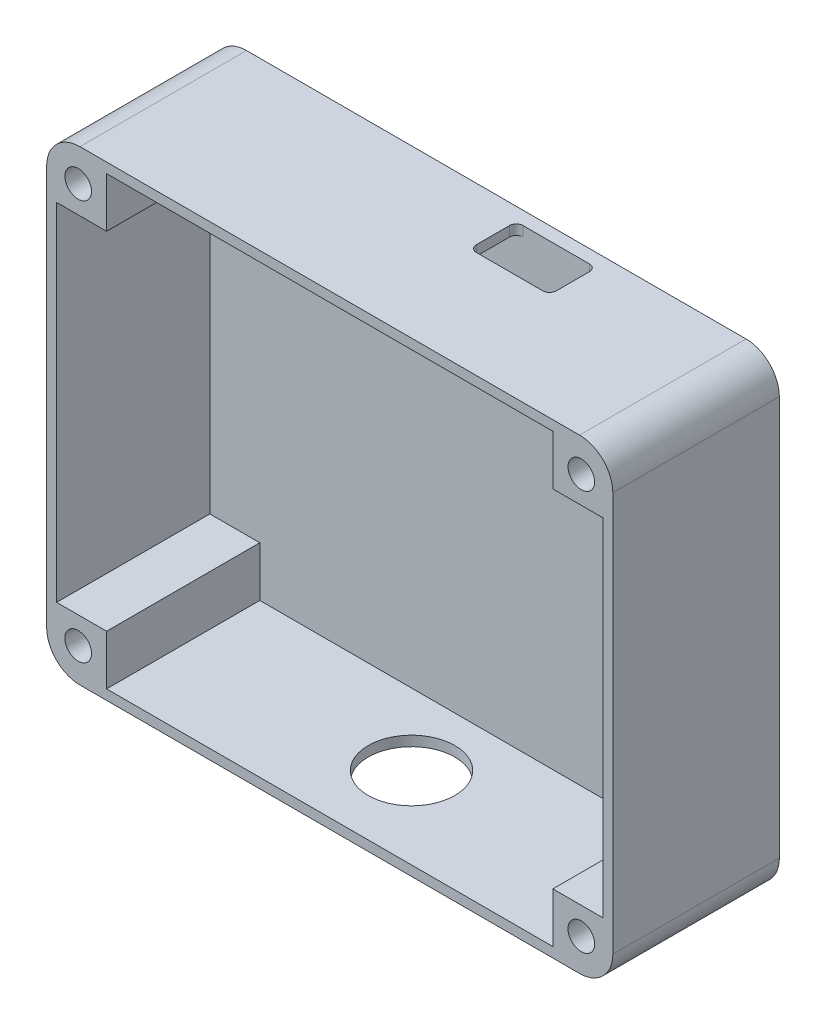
ISO-10303-21;
HEADER;
FILE_DESCRIPTION(('STEP AP214'),'2;1');
FILE_NAME('part.step','',(''),(''),'','','');
FILE_SCHEMA(('AUTOMOTIVE_DESIGN { 1 0 10303 214 1 1 1 1 }'));
ENDSEC;
DATA;
#1=APPLICATION_CONTEXT('core data for automotive mechanical design processes');
#2=APPLICATION_PROTOCOL_DEFINITION('international standard','automotive_design',2000,#1);
#3=PRODUCT_CONTEXT('',#1,'mechanical');
#4=PRODUCT('Part','Part','',(#3));
#5=PRODUCT_RELATED_PRODUCT_CATEGORY('part','',(#4));
#6=PRODUCT_DEFINITION_FORMATION('','',#4);
#7=PRODUCT_DEFINITION_CONTEXT('part definition',#1,'design');
#8=PRODUCT_DEFINITION('design','',#6,#7);
#9=PRODUCT_DEFINITION_SHAPE('','',#8);
#10=(LENGTH_UNIT() NAMED_UNIT(*) SI_UNIT(.MILLI.,.METRE.));
#11=(NAMED_UNIT(*) PLANE_ANGLE_UNIT() SI_UNIT($,.RADIAN.));
#12=(NAMED_UNIT(*) SI_UNIT($,.STERADIAN.) SOLID_ANGLE_UNIT());
#13=UNCERTAINTY_MEASURE_WITH_UNIT(LENGTH_MEASURE(1.E-05),#10,'distance_accuracy_value','');
#14=(GEOMETRIC_REPRESENTATION_CONTEXT(3) GLOBAL_UNCERTAINTY_ASSIGNED_CONTEXT((#13)) GLOBAL_UNIT_ASSIGNED_CONTEXT((#10,
#11,#12)) REPRESENTATION_CONTEXT('',''));
#15=CARTESIAN_POINT('',(0.,0.,0.));
#16=DIRECTION('',(0.,0.,1.));
#17=DIRECTION('',(1.,0.,0.));
#18=AXIS2_PLACEMENT_3D('',#15,#16,#17);
#19=CARTESIAN_POINT('',(37.5,30.,25.));
#20=DIRECTION('',(0.,0.,1.));
#21=DIRECTION('',(1.,0.,0.));
#22=AXIS2_PLACEMENT_3D('',#19,#20,#21);
#23=PLANE('',#22);
#24=CARTESIAN_POINT('',(-37.7680246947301,-30.0366040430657,25.));
#25=DIRECTION('',(0.,0.,1.));
#26=DIRECTION('',(-1.,0.,0.));
#27=AXIS2_PLACEMENT_3D('',#24,#25,#26);
#28=CIRCLE('',#27,2.);
#29=CARTESIAN_POINT('',(-39.7680246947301,-30.0366040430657,25.));
#30=VERTEX_POINT('',#29);
#31=EDGE_CURVE('E274',#30,#30,#28,.T.);
#32=ORIENTED_EDGE('',*,*,#31,.F.);
#33=EDGE_LOOP('',(#32));
#34=FACE_BOUND('',#33,.T.);
#35=CARTESIAN_POINT('',(37.7680246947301,-30.0366040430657,25.));
#36=DIRECTION('',(0.,0.,1.));
#37=DIRECTION('',(1.,0.,0.));
#38=AXIS2_PLACEMENT_3D('',#35,#36,#37);
#39=CIRCLE('',#38,2.);
#40=CARTESIAN_POINT('',(39.7680246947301,-30.0366040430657,25.));
#41=VERTEX_POINT('',#40);
#42=EDGE_CURVE('E285',#41,#41,#39,.T.);
#43=ORIENTED_EDGE('',*,*,#42,.F.);
#44=EDGE_LOOP('',(#43));
#45=FACE_BOUND('',#44,.T.);
#46=CARTESIAN_POINT('',(37.7680246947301,30.0366040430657,25.));
#47=DIRECTION('',(0.,0.,1.));
#48=DIRECTION('',(-1.,0.,0.));
#49=AXIS2_PLACEMENT_3D('',#46,#47,#48);
#50=CIRCLE('',#49,2.);
#51=CARTESIAN_POINT('',(35.7680246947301,30.0366040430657,25.));
#52=VERTEX_POINT('',#51);
#53=EDGE_CURVE('E279',#52,#52,#50,.T.);
#54=ORIENTED_EDGE('',*,*,#53,.F.);
#55=EDGE_LOOP('',(#54));
#56=FACE_BOUND('',#55,.T.);
#57=CARTESIAN_POINT('',(-37.7680246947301,30.0366040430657,25.));
#58=DIRECTION('',(0.,0.,1.));
#59=DIRECTION('',(1.,0.,0.));
#60=AXIS2_PLACEMENT_3D('',#57,#58,#59);
#61=CIRCLE('',#60,2.);
#62=CARTESIAN_POINT('',(-35.7680246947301,30.0366040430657,25.));
#63=VERTEX_POINT('',#62);
#64=EDGE_CURVE('E278',#63,#63,#61,.T.);
#65=ORIENTED_EDGE('',*,*,#64,.F.);
#66=EDGE_LOOP('',(#65));
#67=FACE_BOUND('',#66,.T.);
#68=CARTESIAN_POINT('',(37.5,30.,25.));
#69=DIRECTION('',(0.,0.,1.));
#70=DIRECTION('',(1.,0.,0.));
#71=AXIS2_PLACEMENT_3D('',#68,#69,#70);
#72=CIRCLE('',#71,5.);
#73=CARTESIAN_POINT('',(42.5,30.,25.));
#74=VERTEX_POINT('',#73);
#75=CARTESIAN_POINT('',(37.5,35.,25.));
#76=VERTEX_POINT('',#75);
#77=EDGE_CURVE('E392',#74,#76,#72,.T.);
#78=ORIENTED_EDGE('',*,*,#77,.T.);
#79=DIRECTION('',(-1.,0.,0.));
#80=VECTOR('',#79,1.);
#81=CARTESIAN_POINT('',(-37.5,35.,25.));
#82=LINE('',#81,#80);
#83=CARTESIAN_POINT('',(-37.5,35.,25.));
#84=VERTEX_POINT('',#83);
#85=EDGE_CURVE('E395',#76,#84,#82,.T.);
#86=ORIENTED_EDGE('',*,*,#85,.T.);
#87=CARTESIAN_POINT('',(-37.5,30.,25.));
#88=DIRECTION('',(0.,0.,1.));
#89=DIRECTION('',(-1.,0.,0.));
#90=AXIS2_PLACEMENT_3D('',#87,#88,#89);
#91=CIRCLE('',#90,5.);
#92=CARTESIAN_POINT('',(-42.5,30.,25.));
#93=VERTEX_POINT('',#92);
#94=EDGE_CURVE('E398',#84,#93,#91,.T.);
#95=ORIENTED_EDGE('',*,*,#94,.T.);
#96=DIRECTION('',(0.,-1.,0.));
#97=VECTOR('',#96,1.);
#98=CARTESIAN_POINT('',(-42.5,30.,25.));
#99=LINE('',#98,#97);
#100=CARTESIAN_POINT('',(-42.5,-30.,25.));
#101=VERTEX_POINT('',#100);
#102=EDGE_CURVE('E400',#93,#101,#99,.T.);
#103=ORIENTED_EDGE('',*,*,#102,.T.);
#104=CARTESIAN_POINT('',(-37.5,-30.,25.));
#105=DIRECTION('',(0.,0.,1.));
#106=DIRECTION('',(-1.,0.,0.));
#107=AXIS2_PLACEMENT_3D('',#104,#105,#106);
#108=CIRCLE('',#107,5.);
#109=CARTESIAN_POINT('',(-37.5,-35.,25.));
#110=VERTEX_POINT('',#109);
#111=EDGE_CURVE('E402',#101,#110,#108,.T.);
#112=ORIENTED_EDGE('',*,*,#111,.T.);
#113=DIRECTION('',(1.,0.,0.));
#114=VECTOR('',#113,1.);
#115=CARTESIAN_POINT('',(-37.5,-35.,25.));
#116=LINE('',#115,#114);
#117=CARTESIAN_POINT('',(37.5,-35.,25.));
#118=VERTEX_POINT('',#117);
#119=EDGE_CURVE('E404',#110,#118,#116,.T.);
#120=ORIENTED_EDGE('',*,*,#119,.T.);
#121=CARTESIAN_POINT('',(37.5,-30.,25.));
#122=DIRECTION('',(0.,0.,1.));
#123=DIRECTION('',(-1.,0.,0.));
#124=AXIS2_PLACEMENT_3D('',#121,#122,#123);
#125=CIRCLE('',#124,5.);
#126=CARTESIAN_POINT('',(42.5,-30.,25.));
#127=VERTEX_POINT('',#126);
#128=EDGE_CURVE('E406',#118,#127,#125,.T.);
#129=ORIENTED_EDGE('',*,*,#128,.T.);
#130=DIRECTION('',(0.,1.,0.));
#131=VECTOR('',#130,1.);
#132=CARTESIAN_POINT('',(42.5,30.,25.));
#133=LINE('',#132,#131);
#134=EDGE_CURVE('E408',#127,#74,#133,.T.);
#135=ORIENTED_EDGE('',*,*,#134,.T.);
#136=EDGE_LOOP('',(#78,#86,#95,#103,#112,#120,#129,#135));
#137=FACE_BOUND('',#136,.T.);
#138=DIRECTION('',(0.,1.,0.));
#139=VECTOR('',#138,1.);
#140=CARTESIAN_POINT('',(-33.5000000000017,-2.10757337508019E-12,25.));
#141=LINE('',#140,#139);
#142=CARTESIAN_POINT('',(-33.4999999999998,-33.5,25.));
#143=VERTEX_POINT('',#142);
#144=CARTESIAN_POINT('',(-33.5,-26.,25.));
#145=VERTEX_POINT('',#144);
#146=EDGE_CURVE('E335',#143,#145,#141,.T.);
#147=ORIENTED_EDGE('',*,*,#146,.T.);
#148=DIRECTION('',(-1.,0.,0.));
#149=VECTOR('',#148,1.);
#150=CARTESIAN_POINT('',(0.,-26.,25.));
#151=LINE('',#150,#149);
#152=CARTESIAN_POINT('',(-41.,-26.,25.));
#153=VERTEX_POINT('',#152);
#154=EDGE_CURVE('E296',#145,#153,#151,.T.);
#155=ORIENTED_EDGE('',*,*,#154,.T.);
#156=DIRECTION('',(0.,-1.,0.));
#157=VECTOR('',#156,1.);
#158=CARTESIAN_POINT('',(-41.,0.,25.));
#159=LINE('',#158,#157);
#160=CARTESIAN_POINT('',(-41.,26.,25.));
#161=VERTEX_POINT('',#160);
#162=EDGE_CURVE('E302',#161,#153,#159,.T.);
#163=ORIENTED_EDGE('',*,*,#162,.F.);
#164=DIRECTION('',(-1.,0.,0.));
#165=VECTOR('',#164,1.);
#166=CARTESIAN_POINT('',(0.,26.,25.));
#167=LINE('',#166,#165);
#168=CARTESIAN_POINT('',(-33.5,26.,25.));
#169=VERTEX_POINT('',#168);
#170=EDGE_CURVE('E362',#169,#161,#167,.T.);
#171=ORIENTED_EDGE('',*,*,#170,.F.);
#172=DIRECTION('',(0.,-1.,0.));
#173=VECTOR('',#172,1.);
#174=CARTESIAN_POINT('',(-33.5,0.,25.));
#175=LINE('',#174,#173);
#176=CARTESIAN_POINT('',(-33.5,33.5,25.));
#177=VERTEX_POINT('',#176);
#178=EDGE_CURVE('E359',#177,#169,#175,.T.);
#179=ORIENTED_EDGE('',*,*,#178,.F.);
#180=DIRECTION('',(1.,0.,0.));
#181=VECTOR('',#180,1.);
#182=CARTESIAN_POINT('',(0.,33.5,25.));
#183=LINE('',#182,#181);
#184=CARTESIAN_POINT('',(33.5,33.5,25.));
#185=VERTEX_POINT('',#184);
#186=EDGE_CURVE('E356',#177,#185,#183,.T.);
#187=ORIENTED_EDGE('',*,*,#186,.T.);
#188=DIRECTION('',(0.,-1.,0.));
#189=VECTOR('',#188,1.);
#190=CARTESIAN_POINT('',(33.5,0.,25.));
#191=LINE('',#190,#189);
#192=CARTESIAN_POINT('',(33.5,26.,25.));
#193=VERTEX_POINT('',#192);
#194=EDGE_CURVE('E353',#185,#193,#191,.T.);
#195=ORIENTED_EDGE('',*,*,#194,.T.);
#196=DIRECTION('',(1.,0.,0.));
#197=VECTOR('',#196,1.);
#198=CARTESIAN_POINT('',(0.,26.,25.));
#199=LINE('',#198,#197);
#200=CARTESIAN_POINT('',(41.,26.,25.));
#201=VERTEX_POINT('',#200);
#202=EDGE_CURVE('E350',#193,#201,#199,.T.);
#203=ORIENTED_EDGE('',*,*,#202,.T.);
#204=DIRECTION('',(0.,-1.,0.));
#205=VECTOR('',#204,1.);
#206=CARTESIAN_POINT('',(41.,0.,25.));
#207=LINE('',#206,#205);
#208=CARTESIAN_POINT('',(41.,-26.,25.));
#209=VERTEX_POINT('',#208);
#210=EDGE_CURVE('E347',#201,#209,#207,.T.);
#211=ORIENTED_EDGE('',*,*,#210,.T.);
#212=DIRECTION('',(1.,0.,0.));
#213=VECTOR('',#212,1.);
#214=CARTESIAN_POINT('',(0.,-26.,25.));
#215=LINE('',#214,#213);
#216=CARTESIAN_POINT('',(33.4999999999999,-26.,25.));
#217=VERTEX_POINT('',#216);
#218=EDGE_CURVE('E344',#217,#209,#215,.T.);
#219=ORIENTED_EDGE('',*,*,#218,.F.);
#220=DIRECTION('',(0.,1.,0.));
#221=VECTOR('',#220,1.);
#222=CARTESIAN_POINT('',(33.4999999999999,0.,25.));
#223=LINE('',#222,#221);
#224=CARTESIAN_POINT('',(33.4999999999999,-33.5,25.));
#225=VERTEX_POINT('',#224);
#226=EDGE_CURVE('E341',#225,#217,#223,.T.);
#227=ORIENTED_EDGE('',*,*,#226,.F.);
#228=DIRECTION('',(1.,0.,0.));
#229=VECTOR('',#228,1.);
#230=CARTESIAN_POINT('',(0.,-33.5,25.));
#231=LINE('',#230,#229);
#232=EDGE_CURVE('E338',#143,#225,#231,.T.);
#233=ORIENTED_EDGE('',*,*,#232,.F.);
#234=EDGE_LOOP('',(#147,#155,#163,#171,#179,#187,#195,#203,#211,#219,#227,#233));
#235=FACE_BOUND('',#234,.T.);
#236=ADVANCED_FACE('F38',(#34,#45,#56,#67,#137,#235),#23,.T.);
#237=CARTESIAN_POINT('',(37.5,30.,25.));
#238=DIRECTION('',(0.,0.,-1.));
#239=DIRECTION('',(-1.,0.,0.));
#240=AXIS2_PLACEMENT_3D('',#237,#238,#239);
#241=CYLINDRICAL_SURFACE('',#240,5.);
#242=CARTESIAN_POINT('',(37.5,30.,0.));
#243=DIRECTION('',(0.,0.,1.));
#244=DIRECTION('',(1.,0.,0.));
#245=AXIS2_PLACEMENT_3D('',#242,#243,#244);
#246=CIRCLE('',#245,5.);
#247=CARTESIAN_POINT('',(42.5,30.,0.));
#248=VERTEX_POINT('',#247);
#249=CARTESIAN_POINT('',(37.5,35.,0.));
#250=VERTEX_POINT('',#249);
#251=EDGE_CURVE('E369',#248,#250,#246,.T.);
#252=ORIENTED_EDGE('',*,*,#251,.T.);
#253=DIRECTION('',(0.,0.,-1.));
#254=VECTOR('',#253,1.);
#255=CARTESIAN_POINT('',(37.5,35.,25.));
#256=LINE('',#255,#254);
#257=EDGE_CURVE('E446',#76,#250,#256,.T.);
#258=ORIENTED_EDGE('',*,*,#257,.F.);
#259=ORIENTED_EDGE('',*,*,#77,.F.);
#260=DIRECTION('',(0.,0.,-1.));
#261=VECTOR('',#260,1.);
#262=CARTESIAN_POINT('',(42.5,30.,25.));
#263=LINE('',#262,#261);
#264=EDGE_CURVE('E410',#74,#248,#263,.T.);
#265=ORIENTED_EDGE('',*,*,#264,.T.);
#266=EDGE_LOOP('',(#252,#258,#259,#265));
#267=FACE_BOUND('',#266,.T.);
#268=ADVANCED_FACE('F40',(#267),#241,.T.);
#269=CARTESIAN_POINT('',(-37.5,35.,25.));
#270=DIRECTION('',(0.,-1.,0.));
#271=DIRECTION('',(0.,0.,-1.));
#272=AXIS2_PLACEMENT_3D('',#269,#270,#271);
#273=PLANE('',#272);
#274=DIRECTION('',(0.,0.,-1.));
#275=VECTOR('',#274,1.);
#276=CARTESIAN_POINT('',(17.,35.,3.00000000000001));
#277=LINE('',#276,#275);
#278=CARTESIAN_POINT('',(17.,35.,7.99999999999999));
#279=VERTEX_POINT('',#278);
#280=CARTESIAN_POINT('',(17.,35.,3.00000000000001));
#281=VERTEX_POINT('',#280);
#282=EDGE_CURVE('E234',#279,#281,#277,.T.);
#283=ORIENTED_EDGE('',*,*,#282,.F.);
#284=CARTESIAN_POINT('',(16.,35.,8.));
#285=DIRECTION('',(0.,1.,0.));
#286=DIRECTION('',(0.,0.,1.));
#287=AXIS2_PLACEMENT_3D('',#284,#285,#286);
#288=CIRCLE('',#287,1.);
#289=CARTESIAN_POINT('',(16.,35.,9.));
#290=VERTEX_POINT('',#289);
#291=EDGE_CURVE('E54',#290,#279,#288,.T.);
#292=ORIENTED_EDGE('',*,*,#291,.F.);
#293=DIRECTION('',(1.,0.,0.));
#294=VECTOR('',#293,1.);
#295=CARTESIAN_POINT('',(6.00000000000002,35.,9.));
#296=LINE('',#295,#294);
#297=CARTESIAN_POINT('',(6.00000000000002,35.,9.));
#298=VERTEX_POINT('',#297);
#299=EDGE_CURVE('E256',#298,#290,#296,.T.);
#300=ORIENTED_EDGE('',*,*,#299,.F.);
#301=CARTESIAN_POINT('',(6.00000000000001,35.,8.));
#302=DIRECTION('',(0.,1.,0.));
#303=DIRECTION('',(0.,0.,-1.));
#304=AXIS2_PLACEMENT_3D('',#301,#302,#303);
#305=CIRCLE('',#304,1.);
#306=CARTESIAN_POINT('',(5.00000000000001,35.,7.99999999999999));
#307=VERTEX_POINT('',#306);
#308=EDGE_CURVE('E253',#307,#298,#305,.T.);
#309=ORIENTED_EDGE('',*,*,#308,.F.);
#310=DIRECTION('',(0.,0.,1.));
#311=VECTOR('',#310,1.);
#312=CARTESIAN_POINT('',(5.00000000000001,35.,3.00000000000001));
#313=LINE('',#312,#311);
#314=CARTESIAN_POINT('',(5.00000000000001,35.,3.00000000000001));
#315=VERTEX_POINT('',#314);
#316=EDGE_CURVE('E250',#315,#307,#313,.T.);
#317=ORIENTED_EDGE('',*,*,#316,.F.);
#318=CARTESIAN_POINT('',(6.00000000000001,35.,3.));
#319=DIRECTION('',(0.,1.,0.));
#320=DIRECTION('',(0.,0.,-1.));
#321=AXIS2_PLACEMENT_3D('',#318,#319,#320);
#322=CIRCLE('',#321,1.);
#323=CARTESIAN_POINT('',(6.00000000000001,35.,2.));
#324=VERTEX_POINT('',#323);
#325=EDGE_CURVE('E244',#324,#315,#322,.T.);
#326=ORIENTED_EDGE('',*,*,#325,.F.);
#327=DIRECTION('',(-1.,0.,0.));
#328=VECTOR('',#327,1.);
#329=CARTESIAN_POINT('',(6.00000000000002,35.,2.));
#330=LINE('',#329,#328);
#331=CARTESIAN_POINT('',(16.,35.,2.));
#332=VERTEX_POINT('',#331);
#333=EDGE_CURVE('E242',#332,#324,#330,.T.);
#334=ORIENTED_EDGE('',*,*,#333,.F.);
#335=CARTESIAN_POINT('',(16.,35.,3.));
#336=DIRECTION('',(0.,1.,0.));
#337=DIRECTION('',(0.,0.,1.));
#338=AXIS2_PLACEMENT_3D('',#335,#336,#337);
#339=CIRCLE('',#338,1.);
#340=EDGE_CURVE('E225',#281,#332,#339,.T.);
#341=ORIENTED_EDGE('',*,*,#340,.F.);
#342=EDGE_LOOP('',(#283,#292,#300,#309,#317,#326,#334,#341));
#343=FACE_BOUND('',#342,.T.);
#344=DIRECTION('',(-1.,0.,0.));
#345=VECTOR('',#344,1.);
#346=CARTESIAN_POINT('',(-37.5,35.,0.));
#347=LINE('',#346,#345);
#348=CARTESIAN_POINT('',(-37.5,35.,0.));
#349=VERTEX_POINT('',#348);
#350=EDGE_CURVE('E413',#250,#349,#347,.T.);
#351=ORIENTED_EDGE('',*,*,#350,.T.);
#352=DIRECTION('',(0.,0.,-1.));
#353=VECTOR('',#352,1.);
#354=CARTESIAN_POINT('',(-37.5,35.,25.));
#355=LINE('',#354,#353);
#356=EDGE_CURVE('E443',#84,#349,#355,.T.);
#357=ORIENTED_EDGE('',*,*,#356,.F.);
#358=ORIENTED_EDGE('',*,*,#85,.F.);
#359=ORIENTED_EDGE('',*,*,#257,.T.);
#360=EDGE_LOOP('',(#351,#357,#358,#359));
#361=FACE_BOUND('',#360,.T.);
#362=ADVANCED_FACE('F238',(#343,#361),#273,.F.);
#363=CARTESIAN_POINT('',(-37.5,30.,25.));
#364=DIRECTION('',(0.,0.,-1.));
#365=DIRECTION('',(-1.,0.,0.));
#366=AXIS2_PLACEMENT_3D('',#363,#364,#365);
#367=CYLINDRICAL_SURFACE('',#366,5.);
#368=CARTESIAN_POINT('',(-37.5,30.,0.));
#369=DIRECTION('',(0.,0.,1.));
#370=DIRECTION('',(-1.,0.,0.));
#371=AXIS2_PLACEMENT_3D('',#368,#369,#370);
#372=CIRCLE('',#371,5.);
#373=CARTESIAN_POINT('',(-42.5,30.,0.));
#374=VERTEX_POINT('',#373);
#375=EDGE_CURVE('E415',#349,#374,#372,.T.);
#376=ORIENTED_EDGE('',*,*,#375,.T.);
#377=DIRECTION('',(0.,0.,-1.));
#378=VECTOR('',#377,1.);
#379=CARTESIAN_POINT('',(-42.5,30.,25.));
#380=LINE('',#379,#378);
#381=EDGE_CURVE('E440',#93,#374,#380,.T.);
#382=ORIENTED_EDGE('',*,*,#381,.F.);
#383=ORIENTED_EDGE('',*,*,#94,.F.);
#384=ORIENTED_EDGE('',*,*,#356,.T.);
#385=EDGE_LOOP('',(#376,#382,#383,#384));
#386=FACE_BOUND('',#385,.T.);
#387=ADVANCED_FACE('F533',(#386),#367,.T.);
#388=CARTESIAN_POINT('',(-42.5,30.,25.));
#389=DIRECTION('',(1.,0.,0.));
#390=DIRECTION('',(0.,1.,0.));
#391=AXIS2_PLACEMENT_3D('',#388,#389,#390);
#392=PLANE('',#391);
#393=DIRECTION('',(0.,-1.,0.));
#394=VECTOR('',#393,1.);
#395=CARTESIAN_POINT('',(-42.5,30.,0.));
#396=LINE('',#395,#394);
#397=CARTESIAN_POINT('',(-42.5,-30.,0.));
#398=VERTEX_POINT('',#397);
#399=EDGE_CURVE('E417',#374,#398,#396,.T.);
#400=ORIENTED_EDGE('',*,*,#399,.T.);
#401=DIRECTION('',(0.,0.,-1.));
#402=VECTOR('',#401,1.);
#403=CARTESIAN_POINT('',(-42.5,-30.,25.));
#404=LINE('',#403,#402);
#405=EDGE_CURVE('E437',#101,#398,#404,.T.);
#406=ORIENTED_EDGE('',*,*,#405,.F.);
#407=ORIENTED_EDGE('',*,*,#102,.F.);
#408=ORIENTED_EDGE('',*,*,#381,.T.);
#409=EDGE_LOOP('',(#400,#406,#407,#408));
#410=FACE_BOUND('',#409,.T.);
#411=ADVANCED_FACE('F529',(#410),#392,.F.);
#412=CARTESIAN_POINT('',(-37.5,-30.,25.));
#413=DIRECTION('',(0.,0.,-1.));
#414=DIRECTION('',(-1.,0.,0.));
#415=AXIS2_PLACEMENT_3D('',#412,#413,#414);
#416=CYLINDRICAL_SURFACE('',#415,5.);
#417=CARTESIAN_POINT('',(-37.5,-30.,0.));
#418=DIRECTION('',(0.,0.,1.));
#419=DIRECTION('',(-1.,0.,0.));
#420=AXIS2_PLACEMENT_3D('',#417,#418,#419);
#421=CIRCLE('',#420,5.);
#422=CARTESIAN_POINT('',(-37.5,-35.,0.));
#423=VERTEX_POINT('',#422);
#424=EDGE_CURVE('E419',#398,#423,#421,.T.);
#425=ORIENTED_EDGE('',*,*,#424,.T.);
#426=DIRECTION('',(0.,0.,-1.));
#427=VECTOR('',#426,1.);
#428=CARTESIAN_POINT('',(-37.5,-35.,25.));
#429=LINE('',#428,#427);
#430=EDGE_CURVE('E434',#110,#423,#429,.T.);
#431=ORIENTED_EDGE('',*,*,#430,.F.);
#432=ORIENTED_EDGE('',*,*,#111,.F.);
#433=ORIENTED_EDGE('',*,*,#405,.T.);
#434=EDGE_LOOP('',(#425,#431,#432,#433));
#435=FACE_BOUND('',#434,.T.);
#436=ADVANCED_FACE('F525',(#435),#416,.T.);
#437=CARTESIAN_POINT('',(-37.5,-35.,25.));
#438=DIRECTION('',(0.,1.,0.));
#439=DIRECTION('',(0.,0.,1.));
#440=AXIS2_PLACEMENT_3D('',#437,#438,#439);
#441=PLANE('',#440);
#442=CARTESIAN_POINT('',(0.,-35.,12.7210704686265));
#443=DIRECTION('',(0.,-1.,0.));
#444=DIRECTION('',(0.,0.,-1.));
#445=AXIS2_PLACEMENT_3D('',#442,#443,#444);
#446=CIRCLE('',#445,6.5);
#447=CARTESIAN_POINT('',(0.,-35.,6.22107046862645));
#448=VERTEX_POINT('',#447);
#449=EDGE_CURVE('E798',#448,#448,#446,.T.);
#450=ORIENTED_EDGE('',*,*,#449,.F.);
#451=EDGE_LOOP('',(#450));
#452=FACE_BOUND('',#451,.T.);
#453=DIRECTION('',(1.,0.,0.));
#454=VECTOR('',#453,1.);
#455=CARTESIAN_POINT('',(-37.5,-35.,0.));
#456=LINE('',#455,#454);
#457=CARTESIAN_POINT('',(37.5,-35.,0.));
#458=VERTEX_POINT('',#457);
#459=EDGE_CURVE('E421',#423,#458,#456,.T.);
#460=ORIENTED_EDGE('',*,*,#459,.T.);
#461=DIRECTION('',(0.,0.,-1.));
#462=VECTOR('',#461,1.);
#463=CARTESIAN_POINT('',(37.5,-35.,25.));
#464=LINE('',#463,#462);
#465=EDGE_CURVE('E431',#118,#458,#464,.T.);
#466=ORIENTED_EDGE('',*,*,#465,.F.);
#467=ORIENTED_EDGE('',*,*,#119,.F.);
#468=ORIENTED_EDGE('',*,*,#430,.T.);
#469=EDGE_LOOP('',(#460,#466,#467,#468));
#470=FACE_BOUND('',#469,.T.);
#471=ADVANCED_FACE('F521',(#452,#470),#441,.F.);
#472=CARTESIAN_POINT('',(37.5,-30.,25.));
#473=DIRECTION('',(0.,0.,-1.));
#474=DIRECTION('',(-1.,0.,0.));
#475=AXIS2_PLACEMENT_3D('',#472,#473,#474);
#476=CYLINDRICAL_SURFACE('',#475,5.);
#477=CARTESIAN_POINT('',(37.5,-30.,0.));
#478=DIRECTION('',(0.,0.,1.));
#479=DIRECTION('',(-1.,0.,0.));
#480=AXIS2_PLACEMENT_3D('',#477,#478,#479);
#481=CIRCLE('',#480,5.);
#482=CARTESIAN_POINT('',(42.5,-30.,0.));
#483=VERTEX_POINT('',#482);
#484=EDGE_CURVE('E423',#458,#483,#481,.T.);
#485=ORIENTED_EDGE('',*,*,#484,.T.);
#486=DIRECTION('',(0.,0.,-1.));
#487=VECTOR('',#486,1.);
#488=CARTESIAN_POINT('',(42.5,-30.,25.));
#489=LINE('',#488,#487);
#490=EDGE_CURVE('E428',#127,#483,#489,.T.);
#491=ORIENTED_EDGE('',*,*,#490,.F.);
#492=ORIENTED_EDGE('',*,*,#128,.F.);
#493=ORIENTED_EDGE('',*,*,#465,.T.);
#494=EDGE_LOOP('',(#485,#491,#492,#493));
#495=FACE_BOUND('',#494,.T.);
#496=ADVANCED_FACE('F517',(#495),#476,.T.);
#497=CARTESIAN_POINT('',(42.5,30.,25.));
#498=DIRECTION('',(-1.,0.,0.));
#499=DIRECTION('',(0.,-1.,0.));
#500=AXIS2_PLACEMENT_3D('',#497,#498,#499);
#501=PLANE('',#500);
#502=DIRECTION('',(0.,1.,0.));
#503=VECTOR('',#502,1.);
#504=CARTESIAN_POINT('',(42.5,30.,0.));
#505=LINE('',#504,#503);
#506=EDGE_CURVE('E396',#483,#248,#505,.T.);
#507=ORIENTED_EDGE('',*,*,#506,.T.);
#508=ORIENTED_EDGE('',*,*,#264,.F.);
#509=ORIENTED_EDGE('',*,*,#134,.F.);
#510=ORIENTED_EDGE('',*,*,#490,.T.);
#511=EDGE_LOOP('',(#507,#508,#509,#510));
#512=FACE_BOUND('',#511,.T.);
#513=ADVANCED_FACE('F513',(#512),#501,.F.);
#514=CARTESIAN_POINT('',(37.5,30.,0.));
#515=DIRECTION('',(0.,0.,1.));
#516=DIRECTION('',(1.,0.,0.));
#517=AXIS2_PLACEMENT_3D('',#514,#515,#516);
#518=PLANE('',#517);
#519=ORIENTED_EDGE('',*,*,#251,.F.);
#520=ORIENTED_EDGE('',*,*,#506,.F.);
#521=ORIENTED_EDGE('',*,*,#484,.F.);
#522=ORIENTED_EDGE('',*,*,#459,.F.);
#523=ORIENTED_EDGE('',*,*,#424,.F.);
#524=ORIENTED_EDGE('',*,*,#399,.F.);
#525=ORIENTED_EDGE('',*,*,#375,.F.);
#526=ORIENTED_EDGE('',*,*,#350,.F.);
#527=EDGE_LOOP('',(#519,#520,#521,#522,#523,#524,#525,#526));
#528=FACE_BOUND('',#527,.T.);
#529=ADVANCED_FACE('F510',(#528),#518,.F.);
#530=CARTESIAN_POINT('',(0.,-26.,2.));
#531=DIRECTION('',(0.,1.,0.));
#532=DIRECTION('',(0.,0.,1.));
#533=AXIS2_PLACEMENT_3D('',#530,#531,#532);
#534=PLANE('',#533);
#535=ORIENTED_EDGE('',*,*,#154,.F.);
#536=DIRECTION('',(0.,0.,1.));
#537=VECTOR('',#536,1.);
#538=CARTESIAN_POINT('',(-33.5,-26.,2.));
#539=LINE('',#538,#537);
#540=CARTESIAN_POINT('',(-33.5,-26.,2.));
#541=VERTEX_POINT('',#540);
#542=EDGE_CURVE('E332',#541,#145,#539,.T.);
#543=ORIENTED_EDGE('',*,*,#542,.F.);
#544=DIRECTION('',(-1.,0.,0.));
#545=VECTOR('',#544,1.);
#546=CARTESIAN_POINT('',(0.,-26.,2.));
#547=LINE('',#546,#545);
#548=CARTESIAN_POINT('',(-41.,-26.,2.));
#549=VERTEX_POINT('',#548);
#550=EDGE_CURVE('E299',#541,#549,#547,.T.);
#551=ORIENTED_EDGE('',*,*,#550,.T.);
#552=DIRECTION('',(0.,0.,1.));
#553=VECTOR('',#552,1.);
#554=CARTESIAN_POINT('',(-41.,-26.,2.));
#555=LINE('',#554,#553);
#556=EDGE_CURVE('E367',#549,#153,#555,.T.);
#557=ORIENTED_EDGE('',*,*,#556,.T.);
#558=EDGE_LOOP('',(#535,#543,#551,#557));
#559=FACE_BOUND('',#558,.T.);
#560=ADVANCED_FACE('F508',(#559),#534,.T.);
#561=CARTESIAN_POINT('',(-41.,0.,2.));
#562=DIRECTION('',(-1.,0.,0.));
#563=DIRECTION('',(0.,-1.,0.));
#564=AXIS2_PLACEMENT_3D('',#561,#562,#563);
#565=PLANE('',#564);
#566=ORIENTED_EDGE('',*,*,#162,.T.);
#567=ORIENTED_EDGE('',*,*,#556,.F.);
#568=DIRECTION('',(0.,-1.,0.));
#569=VECTOR('',#568,1.);
#570=CARTESIAN_POINT('',(-41.,0.,2.));
#571=LINE('',#570,#569);
#572=CARTESIAN_POINT('',(-41.,26.,2.));
#573=VERTEX_POINT('',#572);
#574=EDGE_CURVE('E329',#573,#549,#571,.T.);
#575=ORIENTED_EDGE('',*,*,#574,.F.);
#576=DIRECTION('',(0.,0.,1.));
#577=VECTOR('',#576,1.);
#578=CARTESIAN_POINT('',(-41.,26.,2.));
#579=LINE('',#578,#577);
#580=EDGE_CURVE('E370',#573,#161,#579,.T.);
#581=ORIENTED_EDGE('',*,*,#580,.T.);
#582=EDGE_LOOP('',(#566,#567,#575,#581));
#583=FACE_BOUND('',#582,.T.);
#584=ADVANCED_FACE('F580',(#583),#565,.F.);
#585=CARTESIAN_POINT('',(0.,26.,2.));
#586=DIRECTION('',(0.,1.,0.));
#587=DIRECTION('',(0.,0.,1.));
#588=AXIS2_PLACEMENT_3D('',#585,#586,#587);
#589=PLANE('',#588);
#590=ORIENTED_EDGE('',*,*,#170,.T.);
#591=ORIENTED_EDGE('',*,*,#580,.F.);
#592=DIRECTION('',(-1.,0.,0.));
#593=VECTOR('',#592,1.);
#594=CARTESIAN_POINT('',(0.,26.,2.));
#595=LINE('',#594,#593);
#596=CARTESIAN_POINT('',(-33.5,26.,2.));
#597=VERTEX_POINT('',#596);
#598=EDGE_CURVE('E326',#597,#573,#595,.T.);
#599=ORIENTED_EDGE('',*,*,#598,.F.);
#600=DIRECTION('',(0.,0.,1.));
#601=VECTOR('',#600,1.);
#602=CARTESIAN_POINT('',(-33.5,26.,2.));
#603=LINE('',#602,#601);
#604=EDGE_CURVE('E372',#597,#169,#603,.T.);
#605=ORIENTED_EDGE('',*,*,#604,.T.);
#606=EDGE_LOOP('',(#590,#591,#599,#605));
#607=FACE_BOUND('',#606,.T.);
#608=ADVANCED_FACE('F587',(#607),#589,.F.);
#609=CARTESIAN_POINT('',(-33.5,0.,2.));
#610=DIRECTION('',(-1.,0.,0.));
#611=DIRECTION('',(0.,0.,1.));
#612=AXIS2_PLACEMENT_3D('',#609,#610,#611);
#613=PLANE('',#612);
#614=ORIENTED_EDGE('',*,*,#178,.T.);
#615=ORIENTED_EDGE('',*,*,#604,.F.);
#616=DIRECTION('',(0.,-1.,0.));
#617=VECTOR('',#616,1.);
#618=CARTESIAN_POINT('',(-33.5,0.,2.));
#619=LINE('',#618,#617);
#620=CARTESIAN_POINT('',(-33.5,33.5,2.));
#621=VERTEX_POINT('',#620);
#622=EDGE_CURVE('E323',#621,#597,#619,.T.);
#623=ORIENTED_EDGE('',*,*,#622,.F.);
#624=DIRECTION('',(0.,0.,1.));
#625=VECTOR('',#624,1.);
#626=CARTESIAN_POINT('',(-33.5,33.5,2.));
#627=LINE('',#626,#625);
#628=EDGE_CURVE('E374',#621,#177,#627,.T.);
#629=ORIENTED_EDGE('',*,*,#628,.T.);
#630=EDGE_LOOP('',(#614,#615,#623,#629));
#631=FACE_BOUND('',#630,.T.);
#632=ADVANCED_FACE('F595',(#631),#613,.F.);
#633=CARTESIAN_POINT('',(0.,33.5,2.));
#634=DIRECTION('',(0.,-1.,0.));
#635=DIRECTION('',(0.,0.,-1.));
#636=AXIS2_PLACEMENT_3D('',#633,#634,#635);
#637=PLANE('',#636);
#638=CARTESIAN_POINT('',(6.00000000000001,33.5,3.));
#639=DIRECTION('',(0.,-1.,0.));
#640=DIRECTION('',(0.,0.,-1.));
#641=AXIS2_PLACEMENT_3D('',#638,#639,#640);
#642=CIRCLE('',#641,1.);
#643=CARTESIAN_POINT('',(5.00000000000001,33.5,3.00000000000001));
#644=VERTEX_POINT('',#643);
#645=CARTESIAN_POINT('',(6.00000000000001,33.5,2.));
#646=VERTEX_POINT('',#645);
#647=EDGE_CURVE('E272',#644,#646,#642,.T.);
#648=ORIENTED_EDGE('',*,*,#647,.F.);
#649=DIRECTION('',(0.,0.,-1.));
#650=VECTOR('',#649,1.);
#651=CARTESIAN_POINT('',(5.00000000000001,33.5,2.));
#652=LINE('',#651,#650);
#653=CARTESIAN_POINT('',(5.00000000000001,33.5,7.99999999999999));
#654=VERTEX_POINT('',#653);
#655=EDGE_CURVE('E11',#654,#644,#652,.T.);
#656=ORIENTED_EDGE('',*,*,#655,.F.);
#657=CARTESIAN_POINT('',(6.00000000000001,33.5,8.));
#658=DIRECTION('',(0.,-1.,0.));
#659=DIRECTION('',(0.,0.,-1.));
#660=AXIS2_PLACEMENT_3D('',#657,#658,#659);
#661=CIRCLE('',#660,1.);
#662=CARTESIAN_POINT('',(6.00000000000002,33.5,9.));
#663=VERTEX_POINT('',#662);
#664=EDGE_CURVE('E47',#663,#654,#661,.T.);
#665=ORIENTED_EDGE('',*,*,#664,.F.);
#666=DIRECTION('',(-1.,0.,0.));
#667=VECTOR('',#666,1.);
#668=CARTESIAN_POINT('',(0.,33.5,9.));
#669=LINE('',#668,#667);
#670=CARTESIAN_POINT('',(16.,33.5,9.));
#671=VERTEX_POINT('',#670);
#672=EDGE_CURVE('E453',#671,#663,#669,.T.);
#673=ORIENTED_EDGE('',*,*,#672,.F.);
#674=CARTESIAN_POINT('',(16.,33.5,8.));
#675=DIRECTION('',(0.,-1.,0.));
#676=DIRECTION('',(0.,0.,-1.));
#677=AXIS2_PLACEMENT_3D('',#674,#675,#676);
#678=CIRCLE('',#677,1.);
#679=CARTESIAN_POINT('',(17.,33.5,7.99999999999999));
#680=VERTEX_POINT('',#679);
#681=EDGE_CURVE('E451',#680,#671,#678,.T.);
#682=ORIENTED_EDGE('',*,*,#681,.F.);
#683=DIRECTION('',(0.,0.,1.));
#684=VECTOR('',#683,1.);
#685=CARTESIAN_POINT('',(17.,33.5,2.));
#686=LINE('',#685,#684);
#687=CARTESIAN_POINT('',(17.,33.5,3.00000000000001));
#688=VERTEX_POINT('',#687);
#689=EDGE_CURVE('E449',#688,#680,#686,.T.);
#690=ORIENTED_EDGE('',*,*,#689,.F.);
#691=CARTESIAN_POINT('',(16.,33.5,3.));
#692=DIRECTION('',(0.,-1.,0.));
#693=DIRECTION('',(0.,0.,-1.));
#694=AXIS2_PLACEMENT_3D('',#691,#692,#693);
#695=CIRCLE('',#694,1.);
#696=CARTESIAN_POINT('',(16.,33.5,2.));
#697=VERTEX_POINT('',#696);
#698=EDGE_CURVE('E228',#697,#688,#695,.T.);
#699=ORIENTED_EDGE('',*,*,#698,.F.);
#700=DIRECTION('',(1.,0.,0.));
#701=VECTOR('',#700,1.);
#702=CARTESIAN_POINT('',(0.,33.5,2.));
#703=LINE('',#702,#701);
#704=CARTESIAN_POINT('',(33.5,33.5,2.));
#705=VERTEX_POINT('',#704);
#706=EDGE_CURVE('E319',#697,#705,#703,.T.);
#707=ORIENTED_EDGE('',*,*,#706,.T.);
#708=DIRECTION('',(0.,0.,1.));
#709=VECTOR('',#708,1.);
#710=CARTESIAN_POINT('',(33.5,33.5,2.));
#711=LINE('',#710,#709);
#712=EDGE_CURVE('E376',#705,#185,#711,.T.);
#713=ORIENTED_EDGE('',*,*,#712,.T.);
#714=ORIENTED_EDGE('',*,*,#186,.F.);
#715=ORIENTED_EDGE('',*,*,#628,.F.);
#716=EDGE_CURVE('E320',#621,#646,#703,.T.);
#717=ORIENTED_EDGE('',*,*,#716,.T.);
#718=EDGE_LOOP('',(#648,#656,#665,#673,#682,#690,#699,#707,#713,#714,#715,#717));
#719=FACE_BOUND('',#718,.T.);
#720=ADVANCED_FACE('F469',(#719),#637,.T.);
#721=CARTESIAN_POINT('',(33.5,0.,2.));
#722=DIRECTION('',(-1.,0.,0.));
#723=DIRECTION('',(0.,0.,1.));
#724=AXIS2_PLACEMENT_3D('',#721,#722,#723);
#725=PLANE('',#724);
#726=ORIENTED_EDGE('',*,*,#194,.F.);
#727=ORIENTED_EDGE('',*,*,#712,.F.);
#728=DIRECTION('',(0.,-1.,0.));
#729=VECTOR('',#728,1.);
#730=CARTESIAN_POINT('',(33.5,0.,2.));
#731=LINE('',#730,#729);
#732=CARTESIAN_POINT('',(33.5,26.,2.));
#733=VERTEX_POINT('',#732);
#734=EDGE_CURVE('E317',#705,#733,#731,.T.);
#735=ORIENTED_EDGE('',*,*,#734,.T.);
#736=DIRECTION('',(0.,0.,1.));
#737=VECTOR('',#736,1.);
#738=CARTESIAN_POINT('',(33.5,26.,2.));
#739=LINE('',#738,#737);
#740=EDGE_CURVE('E378',#733,#193,#739,.T.);
#741=ORIENTED_EDGE('',*,*,#740,.T.);
#742=EDGE_LOOP('',(#726,#727,#735,#741));
#743=FACE_BOUND('',#742,.T.);
#744=ADVANCED_FACE('F610',(#743),#725,.T.);
#745=CARTESIAN_POINT('',(0.,26.,2.));
#746=DIRECTION('',(0.,-1.,0.));
#747=DIRECTION('',(0.,0.,-1.));
#748=AXIS2_PLACEMENT_3D('',#745,#746,#747);
#749=PLANE('',#748);
#750=ORIENTED_EDGE('',*,*,#202,.F.);
#751=ORIENTED_EDGE('',*,*,#740,.F.);
#752=DIRECTION('',(1.,0.,0.));
#753=VECTOR('',#752,1.);
#754=CARTESIAN_POINT('',(0.,26.,2.));
#755=LINE('',#754,#753);
#756=CARTESIAN_POINT('',(41.,26.,2.));
#757=VERTEX_POINT('',#756);
#758=EDGE_CURVE('E315',#733,#757,#755,.T.);
#759=ORIENTED_EDGE('',*,*,#758,.T.);
#760=DIRECTION('',(0.,0.,1.));
#761=VECTOR('',#760,1.);
#762=CARTESIAN_POINT('',(41.,26.,2.));
#763=LINE('',#762,#761);
#764=EDGE_CURVE('E380',#757,#201,#763,.T.);
#765=ORIENTED_EDGE('',*,*,#764,.T.);
#766=EDGE_LOOP('',(#750,#751,#759,#765));
#767=FACE_BOUND('',#766,.T.);
#768=ADVANCED_FACE('F617',(#767),#749,.T.);
#769=CARTESIAN_POINT('',(41.,0.,2.));
#770=DIRECTION('',(-1.,0.,0.));
#771=DIRECTION('',(0.,-1.,0.));
#772=AXIS2_PLACEMENT_3D('',#769,#770,#771);
#773=PLANE('',#772);
#774=ORIENTED_EDGE('',*,*,#210,.F.);
#775=ORIENTED_EDGE('',*,*,#764,.F.);
#776=DIRECTION('',(0.,-1.,0.));
#777=VECTOR('',#776,1.);
#778=CARTESIAN_POINT('',(41.,0.,2.));
#779=LINE('',#778,#777);
#780=CARTESIAN_POINT('',(41.,-26.,2.));
#781=VERTEX_POINT('',#780);
#782=EDGE_CURVE('E313',#757,#781,#779,.T.);
#783=ORIENTED_EDGE('',*,*,#782,.T.);
#784=DIRECTION('',(0.,0.,1.));
#785=VECTOR('',#784,1.);
#786=CARTESIAN_POINT('',(41.,-26.,2.));
#787=LINE('',#786,#785);
#788=EDGE_CURVE('E382',#781,#209,#787,.T.);
#789=ORIENTED_EDGE('',*,*,#788,.T.);
#790=EDGE_LOOP('',(#774,#775,#783,#789));
#791=FACE_BOUND('',#790,.T.);
#792=ADVANCED_FACE('F625',(#791),#773,.T.);
#793=CARTESIAN_POINT('',(0.,-26.,2.));
#794=DIRECTION('',(0.,-1.,0.));
#795=DIRECTION('',(0.,0.,-1.));
#796=AXIS2_PLACEMENT_3D('',#793,#794,#795);
#797=PLANE('',#796);
#798=ORIENTED_EDGE('',*,*,#218,.T.);
#799=ORIENTED_EDGE('',*,*,#788,.F.);
#800=DIRECTION('',(1.,0.,0.));
#801=VECTOR('',#800,1.);
#802=CARTESIAN_POINT('',(0.,-26.,2.));
#803=LINE('',#802,#801);
#804=CARTESIAN_POINT('',(33.4999999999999,-26.,2.));
#805=VERTEX_POINT('',#804);
#806=EDGE_CURVE('E310',#805,#781,#803,.T.);
#807=ORIENTED_EDGE('',*,*,#806,.F.);
#808=DIRECTION('',(0.,0.,1.));
#809=VECTOR('',#808,1.);
#810=CARTESIAN_POINT('',(33.4999999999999,-26.,2.));
#811=LINE('',#810,#809);
#812=EDGE_CURVE('E384',#805,#217,#811,.T.);
#813=ORIENTED_EDGE('',*,*,#812,.T.);
#814=EDGE_LOOP('',(#798,#799,#807,#813));
#815=FACE_BOUND('',#814,.T.);
#816=ADVANCED_FACE('F633',(#815),#797,.F.);
#817=CARTESIAN_POINT('',(33.4999999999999,0.,2.));
#818=DIRECTION('',(1.,0.,0.));
#819=DIRECTION('',(0.,0.,-1.));
#820=AXIS2_PLACEMENT_3D('',#817,#818,#819);
#821=PLANE('',#820);
#822=ORIENTED_EDGE('',*,*,#226,.T.);
#823=ORIENTED_EDGE('',*,*,#812,.F.);
#824=DIRECTION('',(0.,1.,0.));
#825=VECTOR('',#824,1.);
#826=CARTESIAN_POINT('',(33.4999999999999,0.,2.));
#827=LINE('',#826,#825);
#828=CARTESIAN_POINT('',(33.4999999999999,-33.5,2.));
#829=VERTEX_POINT('',#828);
#830=EDGE_CURVE('E307',#829,#805,#827,.T.);
#831=ORIENTED_EDGE('',*,*,#830,.F.);
#832=DIRECTION('',(0.,0.,1.));
#833=VECTOR('',#832,1.);
#834=CARTESIAN_POINT('',(33.4999999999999,-33.5,2.));
#835=LINE('',#834,#833);
#836=EDGE_CURVE('E386',#829,#225,#835,.T.);
#837=ORIENTED_EDGE('',*,*,#836,.T.);
#838=EDGE_LOOP('',(#822,#823,#831,#837));
#839=FACE_BOUND('',#838,.T.);
#840=ADVANCED_FACE('F641',(#839),#821,.F.);
#841=CARTESIAN_POINT('',(0.,-33.5,2.));
#842=DIRECTION('',(0.,-1.,0.));
#843=DIRECTION('',(0.,0.,-1.));
#844=AXIS2_PLACEMENT_3D('',#841,#842,#843);
#845=PLANE('',#844);
#846=CARTESIAN_POINT('',(0.,-33.5,12.7210704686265));
#847=DIRECTION('',(0.,-1.,0.));
#848=DIRECTION('',(0.,0.,-1.));
#849=AXIS2_PLACEMENT_3D('',#846,#847,#848);
#850=CIRCLE('',#849,6.5);
#851=CARTESIAN_POINT('',(0.,-33.5,6.22107046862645));
#852=VERTEX_POINT('',#851);
#853=EDGE_CURVE('E42',#852,#852,#850,.T.);
#854=ORIENTED_EDGE('',*,*,#853,.T.);
#855=EDGE_LOOP('',(#854));
#856=FACE_BOUND('',#855,.T.);
#857=ORIENTED_EDGE('',*,*,#232,.T.);
#858=ORIENTED_EDGE('',*,*,#836,.F.);
#859=DIRECTION('',(1.,0.,0.));
#860=VECTOR('',#859,1.);
#861=CARTESIAN_POINT('',(0.,-33.5,2.));
#862=LINE('',#861,#860);
#863=CARTESIAN_POINT('',(-33.4999999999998,-33.5,2.));
#864=VERTEX_POINT('',#863);
#865=EDGE_CURVE('E304',#864,#829,#862,.T.);
#866=ORIENTED_EDGE('',*,*,#865,.F.);
#867=DIRECTION('',(0.,0.,1.));
#868=VECTOR('',#867,1.);
#869=CARTESIAN_POINT('',(-33.4999999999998,-33.5,2.));
#870=LINE('',#869,#868);
#871=EDGE_CURVE('E388',#864,#143,#870,.T.);
#872=ORIENTED_EDGE('',*,*,#871,.T.);
#873=EDGE_LOOP('',(#857,#858,#866,#872));
#874=FACE_BOUND('',#873,.T.);
#875=ADVANCED_FACE('F649',(#856,#874),#845,.F.);
#876=CARTESIAN_POINT('',(-33.5000000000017,-2.10757337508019E-12,2.));
#877=DIRECTION('',(1.,0.,0.));
#878=DIRECTION('',(0.,1.,0.));
#879=AXIS2_PLACEMENT_3D('',#876,#877,#878);
#880=PLANE('',#879);
#881=ORIENTED_EDGE('',*,*,#146,.F.);
#882=ORIENTED_EDGE('',*,*,#871,.F.);
#883=DIRECTION('',(0.,1.,0.));
#884=VECTOR('',#883,1.);
#885=CARTESIAN_POINT('',(-33.5000000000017,-2.10757337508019E-12,2.));
#886=LINE('',#885,#884);
#887=EDGE_CURVE('E301',#864,#541,#886,.T.);
#888=ORIENTED_EDGE('',*,*,#887,.T.);
#889=ORIENTED_EDGE('',*,*,#542,.T.);
#890=EDGE_LOOP('',(#881,#882,#888,#889));
#891=FACE_BOUND('',#890,.T.);
#892=ADVANCED_FACE('F657',(#891),#880,.T.);
#893=CARTESIAN_POINT('',(0.,0.,2.));
#894=DIRECTION('',(0.,0.,1.));
#895=DIRECTION('',(1.,0.,0.));
#896=AXIS2_PLACEMENT_3D('',#893,#894,#895);
#897=PLANE('',#896);
#898=ORIENTED_EDGE('',*,*,#706,.F.);
#899=DIRECTION('',(0.,1.,0.));
#900=VECTOR('',#899,1.);
#901=CARTESIAN_POINT('',(16.,31.,2.));
#902=LINE('',#901,#900);
#903=EDGE_CURVE('E230',#697,#332,#902,.T.);
#904=ORIENTED_EDGE('',*,*,#903,.T.);
#905=ORIENTED_EDGE('',*,*,#333,.T.);
#906=DIRECTION('',(0.,1.,0.));
#907=VECTOR('',#906,1.);
#908=CARTESIAN_POINT('',(6.00000000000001,31.,2.));
#909=LINE('',#908,#907);
#910=EDGE_CURVE('E267',#646,#324,#909,.T.);
#911=ORIENTED_EDGE('',*,*,#910,.F.);
#912=ORIENTED_EDGE('',*,*,#716,.F.);
#913=ORIENTED_EDGE('',*,*,#622,.T.);
#914=ORIENTED_EDGE('',*,*,#598,.T.);
#915=ORIENTED_EDGE('',*,*,#574,.T.);
#916=ORIENTED_EDGE('',*,*,#550,.F.);
#917=ORIENTED_EDGE('',*,*,#887,.F.);
#918=ORIENTED_EDGE('',*,*,#865,.T.);
#919=ORIENTED_EDGE('',*,*,#830,.T.);
#920=ORIENTED_EDGE('',*,*,#806,.T.);
#921=ORIENTED_EDGE('',*,*,#782,.F.);
#922=ORIENTED_EDGE('',*,*,#758,.F.);
#923=ORIENTED_EDGE('',*,*,#734,.F.);
#924=EDGE_LOOP('',(#898,#904,#905,#911,#912,#913,#914,#915,#916,#917,#918,#919,#920,#921,#922,#923));
#925=FACE_BOUND('',#924,.T.);
#926=ADVANCED_FACE('F476',(#925),#897,.T.);
#927=CARTESIAN_POINT('',(-37.7680246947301,30.0366040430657,2.));
#928=DIRECTION('',(0.,0.,1.));
#929=DIRECTION('',(1.,0.,0.));
#930=AXIS2_PLACEMENT_3D('',#927,#928,#929);
#931=CYLINDRICAL_SURFACE('',#930,2.);
#932=CARTESIAN_POINT('',(-37.7680246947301,30.0366040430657,2.));
#933=DIRECTION('',(0.,0.,1.));
#934=DIRECTION('',(1.,0.,0.));
#935=AXIS2_PLACEMENT_3D('',#932,#933,#934);
#936=CIRCLE('',#935,2.);
#937=CARTESIAN_POINT('',(-35.7680246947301,30.0366040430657,2.));
#938=VERTEX_POINT('',#937);
#939=EDGE_CURVE('E293',#938,#938,#936,.T.);
#940=ORIENTED_EDGE('',*,*,#939,.F.);
#941=EDGE_LOOP('',(#940));
#942=FACE_BOUND('',#941,.T.);
#943=ORIENTED_EDGE('',*,*,#64,.T.);
#944=EDGE_LOOP('',(#943));
#945=FACE_BOUND('',#944,.T.);
#946=ADVANCED_FACE('F670',(#942,#945),#931,.F.);
#947=CARTESIAN_POINT('',(-37.7680246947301,30.0366040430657,2.));
#948=DIRECTION('',(0.,0.,1.));
#949=DIRECTION('',(1.,0.,0.));
#950=AXIS2_PLACEMENT_3D('',#947,#948,#949);
#951=PLANE('',#950);
#952=ORIENTED_EDGE('',*,*,#939,.T.);
#953=EDGE_LOOP('',(#952));
#954=FACE_BOUND('',#953,.T.);
#955=ADVANCED_FACE('F677',(#954),#951,.T.);
#956=CARTESIAN_POINT('',(37.7680246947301,30.0366040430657,2.));
#957=DIRECTION('',(0.,0.,1.));
#958=DIRECTION('',(1.,0.,0.));
#959=AXIS2_PLACEMENT_3D('',#956,#957,#958);
#960=CYLINDRICAL_SURFACE('',#959,2.);
#961=CARTESIAN_POINT('',(37.7680246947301,30.0366040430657,2.));
#962=DIRECTION('',(0.,0.,1.));
#963=DIRECTION('',(-1.,0.,0.));
#964=AXIS2_PLACEMENT_3D('',#961,#962,#963);
#965=CIRCLE('',#964,2.);
#966=CARTESIAN_POINT('',(35.7680246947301,30.0366040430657,2.));
#967=VERTEX_POINT('',#966);
#968=EDGE_CURVE('E275',#967,#967,#965,.T.);
#969=ORIENTED_EDGE('',*,*,#968,.F.);
#970=EDGE_LOOP('',(#969));
#971=FACE_BOUND('',#970,.T.);
#972=ORIENTED_EDGE('',*,*,#53,.T.);
#973=EDGE_LOOP('',(#972));
#974=FACE_BOUND('',#973,.T.);
#975=ADVANCED_FACE('F685',(#971,#974),#960,.F.);
#976=CARTESIAN_POINT('',(37.7680246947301,30.0366040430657,2.));
#977=DIRECTION('',(0.,0.,-1.));
#978=DIRECTION('',(-1.,0.,0.));
#979=AXIS2_PLACEMENT_3D('',#976,#977,#978);
#980=PLANE('',#979);
#981=ORIENTED_EDGE('',*,*,#968,.T.);
#982=EDGE_LOOP('',(#981));
#983=FACE_BOUND('',#982,.T.);
#984=ADVANCED_FACE('F693',(#983),#980,.F.);
#985=CARTESIAN_POINT('',(37.7680246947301,-30.0366040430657,2.));
#986=DIRECTION('',(0.,0.,1.));
#987=DIRECTION('',(1.,0.,0.));
#988=AXIS2_PLACEMENT_3D('',#985,#986,#987);
#989=CYLINDRICAL_SURFACE('',#988,2.);
#990=CARTESIAN_POINT('',(37.7680246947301,-30.0366040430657,2.));
#991=DIRECTION('',(0.,0.,1.));
#992=DIRECTION('',(1.,0.,0.));
#993=AXIS2_PLACEMENT_3D('',#990,#991,#992);
#994=CIRCLE('',#993,2.);
#995=CARTESIAN_POINT('',(39.7680246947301,-30.0366040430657,2.));
#996=VERTEX_POINT('',#995);
#997=EDGE_CURVE('E282',#996,#996,#994,.T.);
#998=ORIENTED_EDGE('',*,*,#997,.F.);
#999=EDGE_LOOP('',(#998));
#1000=FACE_BOUND('',#999,.T.);
#1001=ORIENTED_EDGE('',*,*,#42,.T.);
#1002=EDGE_LOOP('',(#1001));
#1003=FACE_BOUND('',#1002,.T.);
#1004=ADVANCED_FACE('F701',(#1000,#1003),#989,.F.);
#1005=CARTESIAN_POINT('',(37.7680246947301,-30.0366040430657,2.));
#1006=DIRECTION('',(0.,0.,1.));
#1007=DIRECTION('',(1.,0.,0.));
#1008=AXIS2_PLACEMENT_3D('',#1005,#1006,#1007);
#1009=PLANE('',#1008);
#1010=ORIENTED_EDGE('',*,*,#997,.T.);
#1011=EDGE_LOOP('',(#1010));
#1012=FACE_BOUND('',#1011,.T.);
#1013=ADVANCED_FACE('F708',(#1012),#1009,.T.);
#1014=CARTESIAN_POINT('',(-37.7680246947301,-30.0366040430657,2.));
#1015=DIRECTION('',(0.,0.,1.));
#1016=DIRECTION('',(1.,0.,0.));
#1017=AXIS2_PLACEMENT_3D('',#1014,#1015,#1016);
#1018=CYLINDRICAL_SURFACE('',#1017,2.);
#1019=CARTESIAN_POINT('',(-37.7680246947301,-30.0366040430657,2.));
#1020=DIRECTION('',(0.,0.,1.));
#1021=DIRECTION('',(-1.,0.,0.));
#1022=AXIS2_PLACEMENT_3D('',#1019,#1020,#1021);
#1023=CIRCLE('',#1022,2.);
#1024=CARTESIAN_POINT('',(-39.7680246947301,-30.0366040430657,2.));
#1025=VERTEX_POINT('',#1024);
#1026=EDGE_CURVE('E288',#1025,#1025,#1023,.T.);
#1027=ORIENTED_EDGE('',*,*,#1026,.F.);
#1028=EDGE_LOOP('',(#1027));
#1029=FACE_BOUND('',#1028,.T.);
#1030=ORIENTED_EDGE('',*,*,#31,.T.);
#1031=EDGE_LOOP('',(#1030));
#1032=FACE_BOUND('',#1031,.T.);
#1033=ADVANCED_FACE('F492',(#1029,#1032),#1018,.F.);
#1034=CARTESIAN_POINT('',(-37.7680246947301,-30.0366040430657,2.));
#1035=DIRECTION('',(0.,0.,-1.));
#1036=DIRECTION('',(-1.,0.,0.));
#1037=AXIS2_PLACEMENT_3D('',#1034,#1035,#1036);
#1038=PLANE('',#1037);
#1039=ORIENTED_EDGE('',*,*,#1026,.T.);
#1040=EDGE_LOOP('',(#1039));
#1041=FACE_BOUND('',#1040,.T.);
#1042=ADVANCED_FACE('F485',(#1041),#1038,.F.);
#1043=CARTESIAN_POINT('',(16.,31.,8.));
#1044=DIRECTION('',(0.,1.,0.));
#1045=DIRECTION('',(0.,0.,1.));
#1046=AXIS2_PLACEMENT_3D('',#1043,#1044,#1045);
#1047=CYLINDRICAL_SURFACE('',#1046,1.);
#1048=ORIENTED_EDGE('',*,*,#681,.T.);
#1049=DIRECTION('',(0.,1.,0.));
#1050=VECTOR('',#1049,1.);
#1051=CARTESIAN_POINT('',(16.,31.,9.));
#1052=LINE('',#1051,#1050);
#1053=EDGE_CURVE('E259',#671,#290,#1052,.T.);
#1054=ORIENTED_EDGE('',*,*,#1053,.T.);
#1055=ORIENTED_EDGE('',*,*,#291,.T.);
#1056=DIRECTION('',(0.,1.,0.));
#1057=VECTOR('',#1056,1.);
#1058=CARTESIAN_POINT('',(17.,31.,7.99999999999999));
#1059=LINE('',#1058,#1057);
#1060=EDGE_CURVE('E231',#680,#279,#1059,.T.);
#1061=ORIENTED_EDGE('',*,*,#1060,.F.);
#1062=EDGE_LOOP('',(#1048,#1054,#1055,#1061));
#1063=FACE_BOUND('',#1062,.T.);
#1064=ADVANCED_FACE('F483',(#1063),#1047,.F.);
#1065=CARTESIAN_POINT('',(6.00000000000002,31.,9.));
#1066=DIRECTION('',(0.,0.,1.));
#1067=DIRECTION('',(1.,0.,0.));
#1068=AXIS2_PLACEMENT_3D('',#1065,#1066,#1067);
#1069=PLANE('',#1068);
#1070=ORIENTED_EDGE('',*,*,#672,.T.);
#1071=DIRECTION('',(0.,1.,0.));
#1072=VECTOR('',#1071,1.);
#1073=CARTESIAN_POINT('',(6.00000000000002,31.,9.));
#1074=LINE('',#1073,#1072);
#1075=EDGE_CURVE('E261',#663,#298,#1074,.T.);
#1076=ORIENTED_EDGE('',*,*,#1075,.T.);
#1077=ORIENTED_EDGE('',*,*,#299,.T.);
#1078=ORIENTED_EDGE('',*,*,#1053,.F.);
#1079=EDGE_LOOP('',(#1070,#1076,#1077,#1078));
#1080=FACE_BOUND('',#1079,.T.);
#1081=ADVANCED_FACE('F481',(#1080),#1069,.F.);
#1082=CARTESIAN_POINT('',(6.00000000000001,31.,8.));
#1083=DIRECTION('',(0.,1.,0.));
#1084=DIRECTION('',(0.,0.,1.));
#1085=AXIS2_PLACEMENT_3D('',#1082,#1083,#1084);
#1086=CYLINDRICAL_SURFACE('',#1085,1.);
#1087=ORIENTED_EDGE('',*,*,#664,.T.);
#1088=DIRECTION('',(0.,1.,0.));
#1089=VECTOR('',#1088,1.);
#1090=CARTESIAN_POINT('',(5.00000000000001,31.,7.99999999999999));
#1091=LINE('',#1090,#1089);
#1092=EDGE_CURVE('E263',#654,#307,#1091,.T.);
#1093=ORIENTED_EDGE('',*,*,#1092,.T.);
#1094=ORIENTED_EDGE('',*,*,#308,.T.);
#1095=ORIENTED_EDGE('',*,*,#1075,.F.);
#1096=EDGE_LOOP('',(#1087,#1093,#1094,#1095));
#1097=FACE_BOUND('',#1096,.T.);
#1098=ADVANCED_FACE('F459',(#1097),#1086,.F.);
#1099=CARTESIAN_POINT('',(5.00000000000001,31.,3.00000000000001));
#1100=DIRECTION('',(-1.,0.,0.));
#1101=DIRECTION('',(0.,0.,1.));
#1102=AXIS2_PLACEMENT_3D('',#1099,#1100,#1101);
#1103=PLANE('',#1102);
#1104=ORIENTED_EDGE('',*,*,#655,.T.);
#1105=DIRECTION('',(0.,1.,0.));
#1106=VECTOR('',#1105,1.);
#1107=CARTESIAN_POINT('',(5.00000000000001,31.,3.00000000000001));
#1108=LINE('',#1107,#1106);
#1109=EDGE_CURVE('E265',#644,#315,#1108,.T.);
#1110=ORIENTED_EDGE('',*,*,#1109,.T.);
#1111=ORIENTED_EDGE('',*,*,#316,.T.);
#1112=ORIENTED_EDGE('',*,*,#1092,.F.);
#1113=EDGE_LOOP('',(#1104,#1110,#1111,#1112));
#1114=FACE_BOUND('',#1113,.T.);
#1115=ADVANCED_FACE('F464',(#1114),#1103,.F.);
#1116=CARTESIAN_POINT('',(6.00000000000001,31.,3.));
#1117=DIRECTION('',(0.,1.,0.));
#1118=DIRECTION('',(0.,0.,1.));
#1119=AXIS2_PLACEMENT_3D('',#1116,#1117,#1118);
#1120=CYLINDRICAL_SURFACE('',#1119,1.);
#1121=ORIENTED_EDGE('',*,*,#647,.T.);
#1122=ORIENTED_EDGE('',*,*,#910,.T.);
#1123=ORIENTED_EDGE('',*,*,#325,.T.);
#1124=ORIENTED_EDGE('',*,*,#1109,.F.);
#1125=EDGE_LOOP('',(#1121,#1122,#1123,#1124));
#1126=FACE_BOUND('',#1125,.T.);
#1127=ADVANCED_FACE('F473',(#1126),#1120,.F.);
#1128=CARTESIAN_POINT('',(16.,31.,3.));
#1129=DIRECTION('',(0.,1.,0.));
#1130=DIRECTION('',(0.,0.,1.));
#1131=AXIS2_PLACEMENT_3D('',#1128,#1129,#1130);
#1132=CYLINDRICAL_SURFACE('',#1131,1.);
#1133=ORIENTED_EDGE('',*,*,#698,.T.);
#1134=DIRECTION('',(0.,1.,0.));
#1135=VECTOR('',#1134,1.);
#1136=CARTESIAN_POINT('',(17.,31.,3.00000000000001));
#1137=LINE('',#1136,#1135);
#1138=EDGE_CURVE('E62',#688,#281,#1137,.T.);
#1139=ORIENTED_EDGE('',*,*,#1138,.T.);
#1140=ORIENTED_EDGE('',*,*,#340,.T.);
#1141=ORIENTED_EDGE('',*,*,#903,.F.);
#1142=EDGE_LOOP('',(#1133,#1139,#1140,#1141));
#1143=FACE_BOUND('',#1142,.T.);
#1144=ADVANCED_FACE('F223',(#1143),#1132,.F.);
#1145=CARTESIAN_POINT('',(17.,31.,3.00000000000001));
#1146=DIRECTION('',(1.,0.,0.));
#1147=DIRECTION('',(0.,0.,-1.));
#1148=AXIS2_PLACEMENT_3D('',#1145,#1146,#1147);
#1149=PLANE('',#1148);
#1150=ORIENTED_EDGE('',*,*,#689,.T.);
#1151=ORIENTED_EDGE('',*,*,#1060,.T.);
#1152=ORIENTED_EDGE('',*,*,#282,.T.);
#1153=ORIENTED_EDGE('',*,*,#1138,.F.);
#1154=EDGE_LOOP('',(#1150,#1151,#1152,#1153));
#1155=FACE_BOUND('',#1154,.T.);
#1156=ADVANCED_FACE('F235',(#1155),#1149,.F.);
#1157=CARTESIAN_POINT('',(0.,-31.,12.7210704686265));
#1158=DIRECTION('',(0.,-1.,0.));
#1159=DIRECTION('',(0.,0.,-1.));
#1160=AXIS2_PLACEMENT_3D('',#1157,#1158,#1159);
#1161=CYLINDRICAL_SURFACE('',#1160,6.5);
#1162=ORIENTED_EDGE('',*,*,#449,.T.);
#1163=EDGE_LOOP('',(#1162));
#1164=FACE_BOUND('',#1163,.T.);
#1165=ORIENTED_EDGE('',*,*,#853,.F.);
#1166=EDGE_LOOP('',(#1165));
#1167=FACE_BOUND('',#1166,.T.);
#1168=ADVANCED_FACE('F780',(#1164,#1167),#1161,.F.);
#1169=CLOSED_SHELL('',(#236,#268,#362,#387,#411,#436,#471,#496,#513,#529,#560,#584,#608,#632,
#720,#744,#768,#792,#816,#840,#875,#892,#926,#946,#955,#975,#984,#1004,#1013,#1033,#1042,#1064,
#1081,#1098,#1115,#1127,#1144,#1156,#1168));
#1170=MANIFOLD_SOLID_BREP('B2',#1169);
#1171=ADVANCED_BREP_SHAPE_REPRESENTATION('',(#18,#1170),#14);
#1172=SHAPE_DEFINITION_REPRESENTATION(#9,#1171);
ENDSEC;
END-ISO-10303-21;
